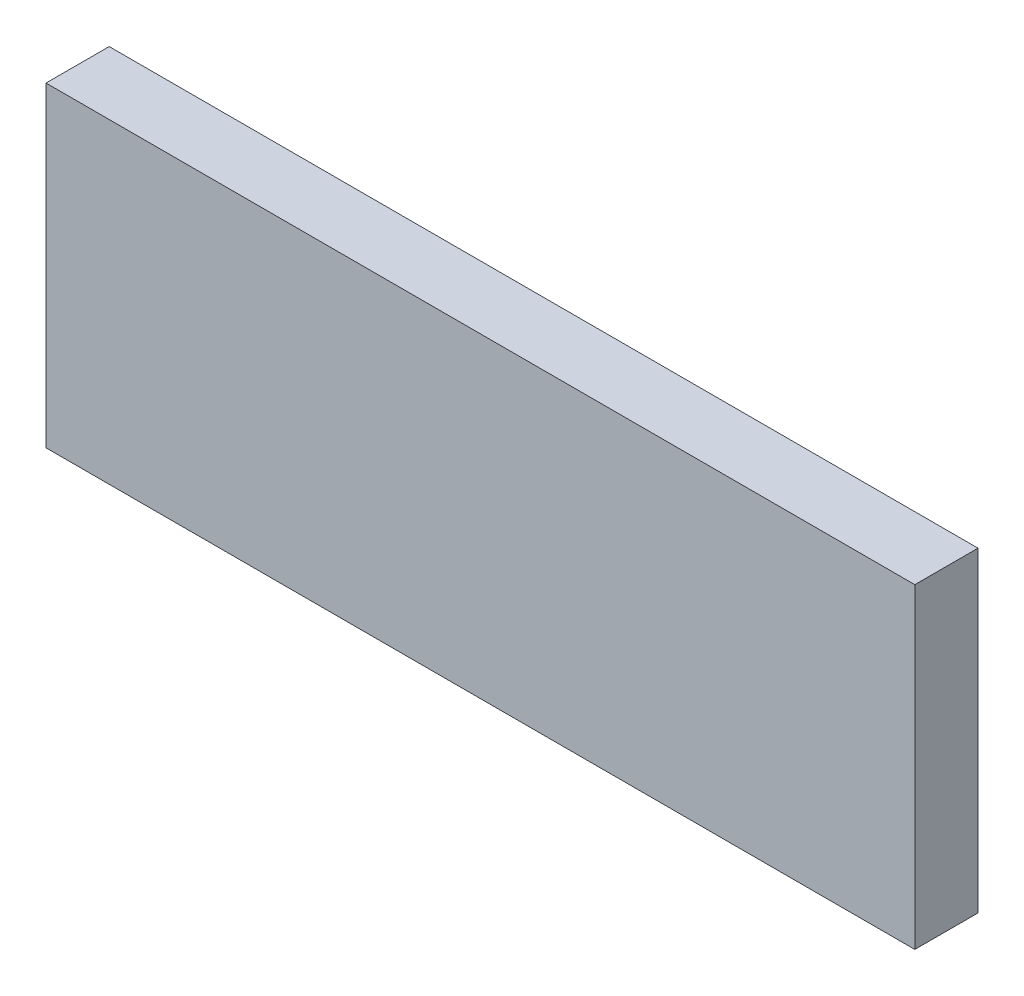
from build123d import *

# Parameters (mm, degrees)
ESQUISSE1_W      = 110
ESQUISSE1_H      = 40
EXTRUSION1_DEPTH = 8


with BuildPart() as part:
    # Esquisse1 → Extrusion1 (new body)
    with BuildSketch(Plane.XY):
        with Locations((55, 20)):
            Rectangle(ESQUISSE1_W, ESQUISSE1_H)
    extrude(amount=EXTRUSION1_DEPTH)


solid = part.part
